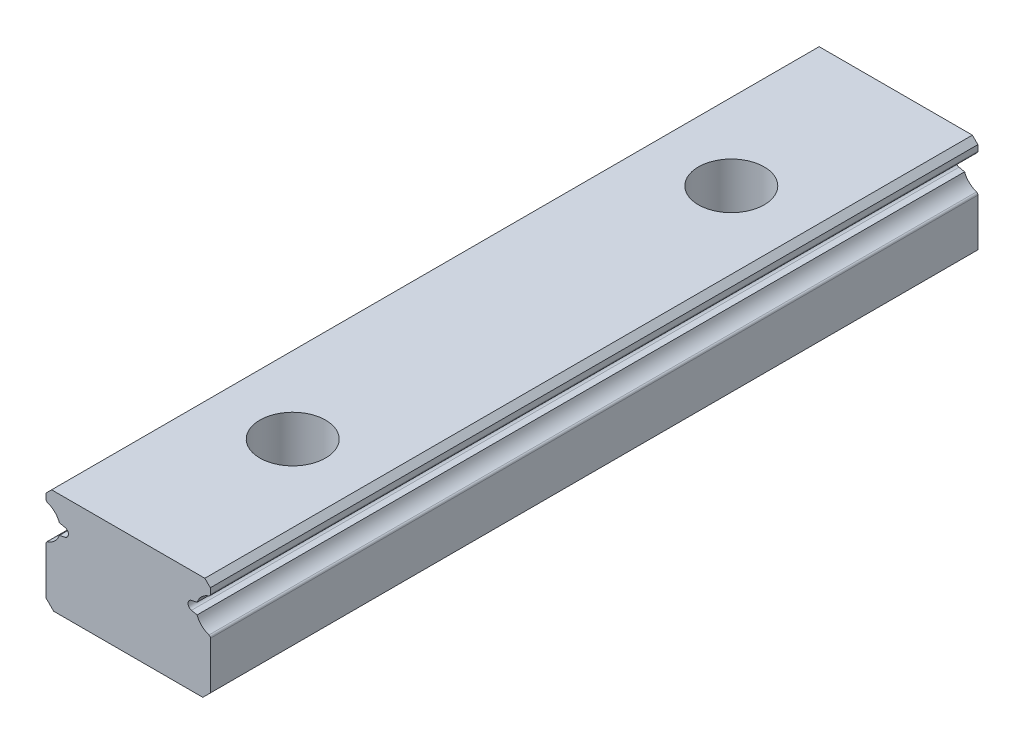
ISO-10303-21;
HEADER;
FILE_DESCRIPTION(('STEP AP214'),'2;1');
FILE_NAME('part.step','',(''),(''),'','','');
FILE_SCHEMA(('AUTOMOTIVE_DESIGN { 1 0 10303 214 1 1 1 1 }'));
ENDSEC;
DATA;
#1=APPLICATION_CONTEXT('core data for automotive mechanical design processes');
#2=APPLICATION_PROTOCOL_DEFINITION('international standard','automotive_design',2000,#1);
#3=PRODUCT_CONTEXT('',#1,'mechanical');
#4=PRODUCT('Part','Part','',(#3));
#5=PRODUCT_RELATED_PRODUCT_CATEGORY('part','',(#4));
#6=PRODUCT_DEFINITION_FORMATION('','',#4);
#7=PRODUCT_DEFINITION_CONTEXT('part definition',#1,'design');
#8=PRODUCT_DEFINITION('design','',#6,#7);
#9=PRODUCT_DEFINITION_SHAPE('','',#8);
#10=(LENGTH_UNIT() NAMED_UNIT(*) SI_UNIT(.MILLI.,.METRE.));
#11=(NAMED_UNIT(*) PLANE_ANGLE_UNIT() SI_UNIT($,.RADIAN.));
#12=(NAMED_UNIT(*) SI_UNIT($,.STERADIAN.) SOLID_ANGLE_UNIT());
#13=UNCERTAINTY_MEASURE_WITH_UNIT(LENGTH_MEASURE(1.E-05),#10,'distance_accuracy_value','');
#14=(GEOMETRIC_REPRESENTATION_CONTEXT(3) GLOBAL_UNCERTAINTY_ASSIGNED_CONTEXT((#13)) GLOBAL_UNIT_ASSIGNED_CONTEXT((#10,
#11,#12)) REPRESENTATION_CONTEXT('',''));
#15=CARTESIAN_POINT('',(0.,0.,0.));
#16=DIRECTION('',(0.,0.,1.));
#17=DIRECTION('',(1.,0.,0.));
#18=AXIS2_PLACEMENT_3D('',#15,#16,#17);
#19=CARTESIAN_POINT('',(-6.27999999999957,-8.749,-70.));
#20=DIRECTION('',(-0.209659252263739,-0.977774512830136,0.));
#21=DIRECTION('',(0.977774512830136,-0.209659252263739,0.));
#22=AXIS2_PLACEMENT_3D('',#19,#20,#21);
#23=PLANE('',#22);
#24=DIRECTION('',(0.977774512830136,-0.209659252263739,0.));
#25=VECTOR('',#24,1.);
#26=CARTESIAN_POINT('',(-6.27999999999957,-8.749,-70.));
#27=LINE('',#26,#25);
#28=CARTESIAN_POINT('',(-6.27999999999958,-8.749,-70.));
#29=VERTEX_POINT('',#28);
#30=CARTESIAN_POINT('',(-5.76751090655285,-8.85889044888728,-70.));
#31=VERTEX_POINT('',#30);
#32=EDGE_CURVE('E211',#29,#31,#27,.T.);
#33=ORIENTED_EDGE('',*,*,#32,.T.);
#34=DIRECTION('',(0.,0.,-1.));
#35=VECTOR('',#34,1.);
#36=CARTESIAN_POINT('',(-5.76751053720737,-8.85889052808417,-70.));
#37=LINE('',#36,#35);
#38=CARTESIAN_POINT('',(-5.76751090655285,-8.85889044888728,0.));
#39=VERTEX_POINT('',#38);
#40=EDGE_CURVE('E182',#31,#39,#37,.F.);
#41=ORIENTED_EDGE('',*,*,#40,.T.);
#42=DIRECTION('',(0.977774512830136,-0.209659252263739,0.));
#43=VECTOR('',#42,1.);
#44=CARTESIAN_POINT('',(-6.27999999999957,-8.749,0.));
#45=LINE('',#44,#43);
#46=CARTESIAN_POINT('',(-6.27999999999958,-8.749,0.));
#47=VERTEX_POINT('',#46);
#48=EDGE_CURVE('E219',#39,#47,#45,.F.);
#49=ORIENTED_EDGE('',*,*,#48,.T.);
#50=DIRECTION('',(0.,0.,-1.));
#51=VECTOR('',#50,1.);
#52=CARTESIAN_POINT('',(-6.27999999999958,-8.749,-70.));
#53=LINE('',#52,#51);
#54=EDGE_CURVE('E214',#47,#29,#53,.T.);
#55=ORIENTED_EDGE('',*,*,#54,.T.);
#56=EDGE_LOOP('',(#33,#41,#49,#55));
#57=FACE_BOUND('',#56,.T.);
#58=ADVANCED_FACE('F16',(#57),#23,.T.);
#59=CARTESIAN_POINT('',(5.7675105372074,-8.85889052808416,-70.));
#60=DIRECTION('',(0.20965925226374,-0.977774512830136,0.));
#61=DIRECTION('',(0.977774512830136,0.20965925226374,0.));
#62=AXIS2_PLACEMENT_3D('',#59,#60,#61);
#63=PLANE('',#62);
#64=DIRECTION('',(0.977774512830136,0.20965925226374,0.));
#65=VECTOR('',#64,1.);
#66=CARTESIAN_POINT('',(5.7675105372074,-8.85889052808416,-70.));
#67=LINE('',#66,#65);
#68=CARTESIAN_POINT('',(5.76751090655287,-8.85889044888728,-70.));
#69=VERTEX_POINT('',#68);
#70=CARTESIAN_POINT('',(6.27999999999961,-8.749,-70.));
#71=VERTEX_POINT('',#70);
#72=EDGE_CURVE('E184',#69,#71,#67,.T.);
#73=ORIENTED_EDGE('',*,*,#72,.T.);
#74=DIRECTION('',(0.,0.,-1.));
#75=VECTOR('',#74,1.);
#76=CARTESIAN_POINT('',(6.27999999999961,-8.749,-70.));
#77=LINE('',#76,#75);
#78=CARTESIAN_POINT('',(6.27999999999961,-8.749,0.));
#79=VERTEX_POINT('',#78);
#80=EDGE_CURVE('E222',#71,#79,#77,.F.);
#81=ORIENTED_EDGE('',*,*,#80,.T.);
#82=DIRECTION('',(0.977774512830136,0.20965925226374,0.));
#83=VECTOR('',#82,1.);
#84=CARTESIAN_POINT('',(5.7675105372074,-8.85889052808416,0.));
#85=LINE('',#84,#83);
#86=CARTESIAN_POINT('',(5.76751090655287,-8.85889044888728,0.));
#87=VERTEX_POINT('',#86);
#88=EDGE_CURVE('E209',#79,#87,#85,.F.);
#89=ORIENTED_EDGE('',*,*,#88,.T.);
#90=DIRECTION('',(0.,0.,-1.));
#91=VECTOR('',#90,1.);
#92=CARTESIAN_POINT('',(5.7675105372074,-8.85889052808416,-70.));
#93=LINE('',#92,#91);
#94=EDGE_CURVE('E204',#87,#69,#93,.T.);
#95=ORIENTED_EDGE('',*,*,#94,.T.);
#96=EDGE_LOOP('',(#73,#81,#89,#95));
#97=FACE_BOUND('',#96,.T.);
#98=ADVANCED_FACE('F749',(#97),#63,.T.);
#99=CARTESIAN_POINT('',(-5.85137497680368,-9.25000017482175,-70.));
#100=DIRECTION('',(0.,0.,-1.));
#101=DIRECTION('',(-1.,0.,0.));
#102=AXIS2_PLACEMENT_3D('',#99,#100,#101);
#103=CYLINDRICAL_SURFACE('',#102,0.4);
#104=ORIENTED_EDGE('',*,*,#40,.F.);
#105=CARTESIAN_POINT('',(-5.85137497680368,-9.25000017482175,-70.));
#106=DIRECTION('',(0.,0.,-1.));
#107=DIRECTION('',(-1.,0.,0.));
#108=AXIS2_PLACEMENT_3D('',#105,#106,#107);
#109=CIRCLE('',#108,0.4);
#110=CARTESIAN_POINT('',(-5.767,-9.641,-70.));
#111=VERTEX_POINT('',#110);
#112=EDGE_CURVE('E19',#111,#31,#109,.F.);
#113=ORIENTED_EDGE('',*,*,#112,.F.);
#114=DIRECTION('',(0.,0.,1.));
#115=VECTOR('',#114,1.);
#116=CARTESIAN_POINT('',(-5.767,-9.641,-70.));
#117=LINE('',#116,#115);
#118=CARTESIAN_POINT('',(-5.767,-9.641,0.));
#119=VERTEX_POINT('',#118);
#120=EDGE_CURVE('E179',#119,#111,#117,.F.);
#121=ORIENTED_EDGE('',*,*,#120,.F.);
#122=CARTESIAN_POINT('',(-5.85137497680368,-9.25000017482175,0.));
#123=DIRECTION('',(0.,0.,-1.));
#124=DIRECTION('',(-1.,0.,0.));
#125=AXIS2_PLACEMENT_3D('',#122,#123,#124);
#126=CIRCLE('',#125,0.4);
#127=EDGE_CURVE('E226',#39,#119,#126,.T.);
#128=ORIENTED_EDGE('',*,*,#127,.F.);
#129=EDGE_LOOP('',(#104,#113,#121,#128));
#130=FACE_BOUND('',#129,.T.);
#131=ADVANCED_FACE('F176',(#130),#103,.F.);
#132=CARTESIAN_POINT('',(7.89004225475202,-9.33975285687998,-70.));
#133=DIRECTION('',(0.,0.,-1.));
#134=DIRECTION('',(-1.,0.,0.));
#135=AXIS2_PLACEMENT_3D('',#132,#133,#134);
#136=CYLINDRICAL_SURFACE('',#135,1.715);
#137=ORIENTED_EDGE('',*,*,#80,.F.);
#138=CARTESIAN_POINT('',(7.89004225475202,-9.33975285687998,-70.));
#139=DIRECTION('',(0.,0.,-1.));
#140=DIRECTION('',(-1.,0.,0.));
#141=AXIS2_PLACEMENT_3D('',#138,#139,#140);
#142=CIRCLE('',#141,1.715);
#143=CARTESIAN_POINT('',(7.35000000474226,-7.71199999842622,-70.));
#144=VERTEX_POINT('',#143);
#145=EDGE_CURVE('E225',#144,#71,#142,.F.);
#146=ORIENTED_EDGE('',*,*,#145,.F.);
#147=DIRECTION('',(0.,0.,-1.));
#148=VECTOR('',#147,1.);
#149=CARTESIAN_POINT('',(7.35000000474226,-7.71199999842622,-70.));
#150=LINE('',#149,#148);
#151=CARTESIAN_POINT('',(7.35000000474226,-7.71199999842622,0.));
#152=VERTEX_POINT('',#151);
#153=EDGE_CURVE('E202',#152,#144,#150,.T.);
#154=ORIENTED_EDGE('',*,*,#153,.F.);
#155=CARTESIAN_POINT('',(7.89004225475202,-9.33975285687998,0.));
#156=DIRECTION('',(0.,0.,-1.));
#157=DIRECTION('',(-1.,0.,0.));
#158=AXIS2_PLACEMENT_3D('',#155,#156,#157);
#159=CIRCLE('',#158,1.715);
#160=EDGE_CURVE('E218',#79,#152,#159,.T.);
#161=ORIENTED_EDGE('',*,*,#160,.F.);
#162=EDGE_LOOP('',(#137,#146,#154,#161));
#163=FACE_BOUND('',#162,.T.);
#164=ADVANCED_FACE('F733',(#163),#136,.F.);
#165=CARTESIAN_POINT('',(-7.890042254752,-9.33975285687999,-70.));
#166=DIRECTION('',(0.,0.,-1.));
#167=DIRECTION('',(-1.,0.,0.));
#168=AXIS2_PLACEMENT_3D('',#165,#166,#167);
#169=CYLINDRICAL_SURFACE('',#168,1.715);
#170=DIRECTION('',(0.,0.,-1.));
#171=VECTOR('',#170,1.);
#172=CARTESIAN_POINT('',(-7.34999999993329,-7.7120000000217,-70.));
#173=LINE('',#172,#171);
#174=CARTESIAN_POINT('',(-7.34999999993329,-7.71200000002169,-70.));
#175=VERTEX_POINT('',#174);
#176=CARTESIAN_POINT('',(-7.34999999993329,-7.7120000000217,0.));
#177=VERTEX_POINT('',#176);
#178=EDGE_CURVE('E285',#175,#177,#173,.F.);
#179=ORIENTED_EDGE('',*,*,#178,.F.);
#180=CARTESIAN_POINT('',(-7.890042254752,-9.33975285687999,-70.));
#181=DIRECTION('',(0.,0.,-1.));
#182=DIRECTION('',(-1.,0.,0.));
#183=AXIS2_PLACEMENT_3D('',#180,#181,#182);
#184=CIRCLE('',#183,1.715);
#185=EDGE_CURVE('E217',#29,#175,#184,.F.);
#186=ORIENTED_EDGE('',*,*,#185,.F.);
#187=ORIENTED_EDGE('',*,*,#54,.F.);
#188=CARTESIAN_POINT('',(-7.890042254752,-9.33975285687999,0.));
#189=DIRECTION('',(0.,0.,-1.));
#190=DIRECTION('',(-1.,0.,0.));
#191=AXIS2_PLACEMENT_3D('',#188,#189,#190);
#192=CIRCLE('',#191,1.715);
#193=EDGE_CURVE('E208',#177,#47,#192,.T.);
#194=ORIENTED_EDGE('',*,*,#193,.F.);
#195=EDGE_LOOP('',(#179,#186,#187,#194));
#196=FACE_BOUND('',#195,.T.);
#197=ADVANCED_FACE('F310',(#196),#169,.F.);
#198=CARTESIAN_POINT('',(5.85137497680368,-9.25000017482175,-70.));
#199=DIRECTION('',(0.,0.,-1.));
#200=DIRECTION('',(-1.,0.,0.));
#201=AXIS2_PLACEMENT_3D('',#198,#199,#200);
#202=CYLINDRICAL_SURFACE('',#201,0.4);
#203=DIRECTION('',(0.,0.,1.));
#204=VECTOR('',#203,1.);
#205=CARTESIAN_POINT('',(5.767,-9.641,-70.));
#206=LINE('',#205,#204);
#207=CARTESIAN_POINT('',(5.767,-9.641,-70.));
#208=VERTEX_POINT('',#207);
#209=CARTESIAN_POINT('',(5.767,-9.641,0.));
#210=VERTEX_POINT('',#209);
#211=EDGE_CURVE('E281',#208,#210,#206,.T.);
#212=ORIENTED_EDGE('',*,*,#211,.F.);
#213=CARTESIAN_POINT('',(5.85137497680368,-9.25000017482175,-70.));
#214=DIRECTION('',(0.,0.,-1.));
#215=DIRECTION('',(-1.,0.,0.));
#216=AXIS2_PLACEMENT_3D('',#213,#214,#215);
#217=CIRCLE('',#216,0.4);
#218=EDGE_CURVE('E207',#69,#208,#217,.F.);
#219=ORIENTED_EDGE('',*,*,#218,.F.);
#220=ORIENTED_EDGE('',*,*,#94,.F.);
#221=CARTESIAN_POINT('',(5.85137497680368,-9.25000017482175,0.));
#222=DIRECTION('',(0.,0.,-1.));
#223=DIRECTION('',(-1.,0.,0.));
#224=AXIS2_PLACEMENT_3D('',#221,#222,#223);
#225=CIRCLE('',#224,0.4);
#226=EDGE_CURVE('E198',#210,#87,#225,.T.);
#227=ORIENTED_EDGE('',*,*,#226,.F.);
#228=EDGE_LOOP('',(#212,#219,#220,#227));
#229=FACE_BOUND('',#228,.T.);
#230=ADVANCED_FACE('F717',(#229),#202,.F.);
#231=CARTESIAN_POINT('',(-5.767,-9.641,-70.));
#232=DIRECTION('',(-0.207835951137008,0.978163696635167,0.));
#233=DIRECTION('',(-0.978163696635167,-0.207835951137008,0.));
#234=AXIS2_PLACEMENT_3D('',#231,#232,#233);
#235=PLANE('',#234);
#236=DIRECTION('',(-0.978163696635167,-0.207835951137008,0.));
#237=VECTOR('',#236,1.);
#238=CARTESIAN_POINT('',(-5.767,-9.641,-70.));
#239=LINE('',#238,#237);
#240=CARTESIAN_POINT('',(-6.28,-9.75,-70.));
#241=VERTEX_POINT('',#240);
#242=EDGE_CURVE('E186',#111,#241,#239,.T.);
#243=ORIENTED_EDGE('',*,*,#242,.T.);
#244=DIRECTION('',(0.,0.,-1.));
#245=VECTOR('',#244,1.);
#246=CARTESIAN_POINT('',(-6.28,-9.75,-70.));
#247=LINE('',#246,#245);
#248=CARTESIAN_POINT('',(-6.28,-9.75,0.));
#249=VERTEX_POINT('',#248);
#250=EDGE_CURVE('E279',#241,#249,#247,.F.);
#251=ORIENTED_EDGE('',*,*,#250,.T.);
#252=DIRECTION('',(-0.978163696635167,-0.207835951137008,0.));
#253=VECTOR('',#252,1.);
#254=CARTESIAN_POINT('',(-5.767,-9.641,0.));
#255=LINE('',#254,#253);
#256=EDGE_CURVE('E196',#249,#119,#255,.F.);
#257=ORIENTED_EDGE('',*,*,#256,.T.);
#258=ORIENTED_EDGE('',*,*,#120,.T.);
#259=EDGE_LOOP('',(#243,#251,#257,#258));
#260=FACE_BOUND('',#259,.T.);
#261=ADVANCED_FACE('F195',(#260),#235,.T.);
#262=CARTESIAN_POINT('',(7.287,-7.52218166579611,-70.));
#263=DIRECTION('',(0.,0.,-1.));
#264=DIRECTION('',(-1.,0.,0.));
#265=AXIS2_PLACEMENT_3D('',#262,#263,#264);
#266=CYLINDRICAL_SURFACE('',#265,0.2);
#267=CARTESIAN_POINT('',(7.287,-7.52218166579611,-70.));
#268=DIRECTION('',(0.,0.,-1.));
#269=DIRECTION('',(-1.,0.,0.));
#270=AXIS2_PLACEMENT_3D('',#267,#268,#269);
#271=CIRCLE('',#270,0.2);
#272=CARTESIAN_POINT('',(7.487,-7.52218165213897,-70.));
#273=VERTEX_POINT('',#272);
#274=EDGE_CURVE('E289',#144,#273,#271,.F.);
#275=ORIENTED_EDGE('',*,*,#274,.T.);
#276=DIRECTION('',(0.,0.,-1.));
#277=VECTOR('',#276,1.);
#278=CARTESIAN_POINT('',(7.487,-7.52218163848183,-70.));
#279=LINE('',#278,#277);
#280=CARTESIAN_POINT('',(7.487,-7.52218165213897,0.));
#281=VERTEX_POINT('',#280);
#282=EDGE_CURVE('E347',#281,#273,#279,.T.);
#283=ORIENTED_EDGE('',*,*,#282,.F.);
#284=CARTESIAN_POINT('',(7.287,-7.52218166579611,0.));
#285=DIRECTION('',(0.,0.,-1.));
#286=DIRECTION('',(-1.,0.,0.));
#287=AXIS2_PLACEMENT_3D('',#284,#285,#286);
#288=CIRCLE('',#287,0.2);
#289=EDGE_CURVE('E193',#281,#152,#288,.T.);
#290=ORIENTED_EDGE('',*,*,#289,.T.);
#291=ORIENTED_EDGE('',*,*,#153,.T.);
#292=EDGE_LOOP('',(#275,#283,#290,#291));
#293=FACE_BOUND('',#292,.T.);
#294=ADVANCED_FACE('F702',(#293),#266,.T.);
#295=CARTESIAN_POINT('',(-7.288,-7.52185268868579,-70.));
#296=DIRECTION('',(0.,0.,-1.));
#297=DIRECTION('',(-1.,0.,0.));
#298=AXIS2_PLACEMENT_3D('',#295,#296,#297);
#299=CYLINDRICAL_SURFACE('',#298,0.200000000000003);
#300=CARTESIAN_POINT('',(-7.288,-7.52185268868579,-70.));
#301=DIRECTION('',(0.,0.,-1.));
#302=DIRECTION('',(-1.,0.,0.));
#303=AXIS2_PLACEMENT_3D('',#300,#301,#302);
#304=CIRCLE('',#303,0.200000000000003);
#305=CARTESIAN_POINT('',(-7.488,-7.52185267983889,-70.));
#306=VERTEX_POINT('',#305);
#307=EDGE_CURVE('E282',#306,#175,#304,.F.);
#308=ORIENTED_EDGE('',*,*,#307,.T.);
#309=ORIENTED_EDGE('',*,*,#178,.T.);
#310=CARTESIAN_POINT('',(-7.288,-7.52185268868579,0.));
#311=DIRECTION('',(0.,0.,-1.));
#312=DIRECTION('',(-1.,0.,0.));
#313=AXIS2_PLACEMENT_3D('',#310,#311,#312);
#314=CIRCLE('',#313,0.200000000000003);
#315=CARTESIAN_POINT('',(-7.488,-7.52185267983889,0.));
#316=VERTEX_POINT('',#315);
#317=EDGE_CURVE('E286',#177,#316,#314,.T.);
#318=ORIENTED_EDGE('',*,*,#317,.T.);
#319=DIRECTION('',(0.,0.,1.));
#320=VECTOR('',#319,1.);
#321=CARTESIAN_POINT('',(-7.488,-7.52185267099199,-70.));
#322=LINE('',#321,#320);
#323=EDGE_CURVE('E315',#306,#316,#322,.T.);
#324=ORIENTED_EDGE('',*,*,#323,.F.);
#325=EDGE_LOOP('',(#308,#309,#318,#324));
#326=FACE_BOUND('',#325,.T.);
#327=ADVANCED_FACE('F313',(#326),#299,.T.);
#328=CARTESIAN_POINT('',(6.28,-9.75,-70.));
#329=DIRECTION('',(0.207835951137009,0.978163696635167,0.));
#330=DIRECTION('',(-0.978163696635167,0.207835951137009,0.));
#331=AXIS2_PLACEMENT_3D('',#328,#329,#330);
#332=PLANE('',#331);
#333=DIRECTION('',(-0.978163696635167,0.207835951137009,0.));
#334=VECTOR('',#333,1.);
#335=CARTESIAN_POINT('',(6.28,-9.75,-70.));
#336=LINE('',#335,#334);
#337=CARTESIAN_POINT('',(6.28,-9.75,-70.));
#338=VERTEX_POINT('',#337);
#339=EDGE_CURVE('E371',#338,#208,#336,.T.);
#340=ORIENTED_EDGE('',*,*,#339,.T.);
#341=ORIENTED_EDGE('',*,*,#211,.T.);
#342=DIRECTION('',(-0.978163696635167,0.207835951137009,0.));
#343=VECTOR('',#342,1.);
#344=CARTESIAN_POINT('',(6.28,-9.75,0.));
#345=LINE('',#344,#343);
#346=CARTESIAN_POINT('',(6.28,-9.75,0.));
#347=VERTEX_POINT('',#346);
#348=EDGE_CURVE('E312',#210,#347,#345,.F.);
#349=ORIENTED_EDGE('',*,*,#348,.T.);
#350=DIRECTION('',(0.,0.,-1.));
#351=VECTOR('',#350,1.);
#352=CARTESIAN_POINT('',(6.28,-9.75,-70.));
#353=LINE('',#352,#351);
#354=EDGE_CURVE('E275',#347,#338,#353,.T.);
#355=ORIENTED_EDGE('',*,*,#354,.T.);
#356=EDGE_LOOP('',(#340,#341,#349,#355));
#357=FACE_BOUND('',#356,.T.);
#358=ADVANCED_FACE('F478',(#357),#332,.T.);
#359=CARTESIAN_POINT('',(-7.89007044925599,-9.159323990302,-70.));
#360=DIRECTION('',(0.,0.,-1.));
#361=DIRECTION('',(-1.,0.,0.));
#362=AXIS2_PLACEMENT_3D('',#359,#360,#361);
#363=CYLINDRICAL_SURFACE('',#362,1.715);
#364=ORIENTED_EDGE('',*,*,#250,.F.);
#365=CARTESIAN_POINT('',(-7.89007044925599,-9.159323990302,-70.));
#366=DIRECTION('',(0.,0.,-1.));
#367=DIRECTION('',(-1.,0.,0.));
#368=AXIS2_PLACEMENT_3D('',#365,#366,#367);
#369=CIRCLE('',#368,1.715);
#370=CARTESIAN_POINT('',(-7.36199999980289,-10.7909999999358,-70.));
#371=VERTEX_POINT('',#370);
#372=EDGE_CURVE('E189',#371,#241,#369,.F.);
#373=ORIENTED_EDGE('',*,*,#372,.F.);
#374=DIRECTION('',(0.,0.,-1.));
#375=VECTOR('',#374,1.);
#376=CARTESIAN_POINT('',(-7.36199999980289,-10.7909999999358,-70.));
#377=LINE('',#376,#375);
#378=CARTESIAN_POINT('',(-7.36199999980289,-10.7909999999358,0.));
#379=VERTEX_POINT('',#378);
#380=EDGE_CURVE('E266',#379,#371,#377,.T.);
#381=ORIENTED_EDGE('',*,*,#380,.F.);
#382=CARTESIAN_POINT('',(-7.89007044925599,-9.159323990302,0.));
#383=DIRECTION('',(0.,0.,-1.));
#384=DIRECTION('',(-1.,0.,0.));
#385=AXIS2_PLACEMENT_3D('',#382,#383,#384);
#386=CIRCLE('',#385,1.715);
#387=EDGE_CURVE('E276',#249,#379,#386,.T.);
#388=ORIENTED_EDGE('',*,*,#387,.F.);
#389=EDGE_LOOP('',(#364,#373,#381,#388));
#390=FACE_BOUND('',#389,.T.);
#391=ADVANCED_FACE('F475',(#390),#363,.F.);
#392=CARTESIAN_POINT('',(7.487,-7.52218163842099,-70.));
#393=DIRECTION('',(1.,0.,0.));
#394=DIRECTION('',(0.,0.,-1.));
#395=AXIS2_PLACEMENT_3D('',#392,#393,#394);
#396=PLANE('',#395);
#397=DIRECTION('',(0.,1.,0.));
#398=VECTOR('',#397,1.);
#399=CARTESIAN_POINT('',(7.487,-7.52218163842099,-70.));
#400=LINE('',#399,#398);
#401=CARTESIAN_POINT('',(7.487,-7.,-70.));
#402=VERTEX_POINT('',#401);
#403=EDGE_CURVE('E327',#273,#402,#400,.T.);
#404=ORIENTED_EDGE('',*,*,#403,.T.);
#405=DIRECTION('',(0.,0.,1.));
#406=VECTOR('',#405,1.);
#407=CARTESIAN_POINT('',(7.487,-7.,-70.));
#408=LINE('',#407,#406);
#409=CARTESIAN_POINT('',(7.487,-7.,0.));
#410=VERTEX_POINT('',#409);
#411=EDGE_CURVE('E354',#410,#402,#408,.F.);
#412=ORIENTED_EDGE('',*,*,#411,.F.);
#413=DIRECTION('',(0.,1.,0.));
#414=VECTOR('',#413,1.);
#415=CARTESIAN_POINT('',(7.487,-7.52218163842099,0.));
#416=LINE('',#415,#414);
#417=EDGE_CURVE('E278',#410,#281,#416,.F.);
#418=ORIENTED_EDGE('',*,*,#417,.T.);
#419=ORIENTED_EDGE('',*,*,#282,.T.);
#420=EDGE_LOOP('',(#404,#412,#418,#419));
#421=FACE_BOUND('',#420,.T.);
#422=ADVANCED_FACE('F477',(#421),#396,.T.);
#423=CARTESIAN_POINT('',(-7.488,-7.,-70.));
#424=DIRECTION('',(-1.,0.,0.));
#425=DIRECTION('',(0.,0.,1.));
#426=AXIS2_PLACEMENT_3D('',#423,#424,#425);
#427=PLANE('',#426);
#428=DIRECTION('',(0.,1.,0.));
#429=VECTOR('',#428,1.);
#430=CARTESIAN_POINT('',(-7.488,-7.,-70.));
#431=LINE('',#430,#429);
#432=CARTESIAN_POINT('',(-7.488,-7.,-70.));
#433=VERTEX_POINT('',#432);
#434=EDGE_CURVE('E319',#433,#306,#431,.F.);
#435=ORIENTED_EDGE('',*,*,#434,.T.);
#436=ORIENTED_EDGE('',*,*,#323,.T.);
#437=DIRECTION('',(0.,1.,0.));
#438=VECTOR('',#437,1.);
#439=CARTESIAN_POINT('',(-7.488,-7.,0.));
#440=LINE('',#439,#438);
#441=CARTESIAN_POINT('',(-7.488,-7.,0.));
#442=VERTEX_POINT('',#441);
#443=EDGE_CURVE('E325',#316,#442,#440,.T.);
#444=ORIENTED_EDGE('',*,*,#443,.T.);
#445=DIRECTION('',(0.,0.,1.));
#446=VECTOR('',#445,1.);
#447=CARTESIAN_POINT('',(-7.488,-7.,-70.));
#448=LINE('',#447,#446);
#449=EDGE_CURVE('E262',#433,#442,#448,.T.);
#450=ORIENTED_EDGE('',*,*,#449,.F.);
#451=EDGE_LOOP('',(#435,#436,#444,#450));
#452=FACE_BOUND('',#451,.T.);
#453=ADVANCED_FACE('F322',(#452),#427,.T.);
#454=CARTESIAN_POINT('',(7.890070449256,-9.159323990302,-70.));
#455=DIRECTION('',(0.,0.,-1.));
#456=DIRECTION('',(-1.,0.,0.));
#457=AXIS2_PLACEMENT_3D('',#454,#455,#456);
#458=CYLINDRICAL_SURFACE('',#457,1.715);
#459=DIRECTION('',(0.,0.,-1.));
#460=VECTOR('',#459,1.);
#461=CARTESIAN_POINT('',(7.36199999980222,-10.7909999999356,-70.));
#462=LINE('',#461,#460);
#463=CARTESIAN_POINT('',(7.36199999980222,-10.7909999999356,-70.));
#464=VERTEX_POINT('',#463);
#465=CARTESIAN_POINT('',(7.36199999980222,-10.7909999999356,0.));
#466=VERTEX_POINT('',#465);
#467=EDGE_CURVE('E256',#464,#466,#462,.F.);
#468=ORIENTED_EDGE('',*,*,#467,.F.);
#469=CARTESIAN_POINT('',(7.890070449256,-9.159323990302,-70.));
#470=DIRECTION('',(0.,0.,-1.));
#471=DIRECTION('',(-1.,0.,0.));
#472=AXIS2_PLACEMENT_3D('',#469,#470,#471);
#473=CIRCLE('',#472,1.715);
#474=EDGE_CURVE('E273',#338,#464,#473,.F.);
#475=ORIENTED_EDGE('',*,*,#474,.F.);
#476=ORIENTED_EDGE('',*,*,#354,.F.);
#477=CARTESIAN_POINT('',(7.890070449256,-9.159323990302,0.));
#478=DIRECTION('',(0.,0.,-1.));
#479=DIRECTION('',(-1.,0.,0.));
#480=AXIS2_PLACEMENT_3D('',#477,#478,#479);
#481=CIRCLE('',#480,1.715);
#482=EDGE_CURVE('E270',#466,#347,#481,.T.);
#483=ORIENTED_EDGE('',*,*,#482,.F.);
#484=EDGE_LOOP('',(#468,#475,#476,#483));
#485=FACE_BOUND('',#484,.T.);
#486=ADVANCED_FACE('F552',(#485),#458,.F.);
#487=CARTESIAN_POINT('',(-7.3,-10.9811473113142,-70.));
#488=DIRECTION('',(0.,0.,-1.));
#489=DIRECTION('',(-1.,0.,0.));
#490=AXIS2_PLACEMENT_3D('',#487,#488,#489);
#491=CYLINDRICAL_SURFACE('',#490,0.200000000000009);
#492=CARTESIAN_POINT('',(-7.3,-10.9811473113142,-70.));
#493=DIRECTION('',(0.,0.,-1.));
#494=DIRECTION('',(-1.,0.,0.));
#495=AXIS2_PLACEMENT_3D('',#492,#493,#494);
#496=CIRCLE('',#495,0.200000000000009);
#497=CARTESIAN_POINT('',(-7.5,-10.9811473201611,-70.));
#498=VERTEX_POINT('',#497);
#499=EDGE_CURVE('E263',#371,#498,#496,.F.);
#500=ORIENTED_EDGE('',*,*,#499,.T.);
#501=DIRECTION('',(0.,0.,1.));
#502=VECTOR('',#501,1.);
#503=CARTESIAN_POINT('',(-7.5,-10.981147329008,-70.));
#504=LINE('',#503,#502);
#505=CARTESIAN_POINT('',(-7.5,-10.9811473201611,0.));
#506=VERTEX_POINT('',#505);
#507=EDGE_CURVE('E252',#506,#498,#504,.F.);
#508=ORIENTED_EDGE('',*,*,#507,.F.);
#509=CARTESIAN_POINT('',(-7.3,-10.9811473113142,0.));
#510=DIRECTION('',(0.,0.,-1.));
#511=DIRECTION('',(-1.,0.,0.));
#512=AXIS2_PLACEMENT_3D('',#509,#510,#511);
#513=CIRCLE('',#512,0.200000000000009);
#514=EDGE_CURVE('E267',#506,#379,#513,.T.);
#515=ORIENTED_EDGE('',*,*,#514,.T.);
#516=ORIENTED_EDGE('',*,*,#380,.T.);
#517=EDGE_LOOP('',(#500,#508,#515,#516));
#518=FACE_BOUND('',#517,.T.);
#519=ADVANCED_FACE('F471',(#518),#491,.T.);
#520=CARTESIAN_POINT('',(0.,-16.,-15.));
#521=DIRECTION('',(0.,1.,0.));
#522=DIRECTION('',(0.,0.,1.));
#523=AXIS2_PLACEMENT_3D('',#520,#521,#522);
#524=CYLINDRICAL_SURFACE('',#523,3.);
#525=CARTESIAN_POINT('',(0.,-6.5,-15.));
#526=DIRECTION('',(0.,1.,0.));
#527=DIRECTION('',(0.,0.,1.));
#528=AXIS2_PLACEMENT_3D('',#525,#526,#527);
#529=CIRCLE('',#528,3.);
#530=CARTESIAN_POINT('',(0.,-6.5,-12.));
#531=VERTEX_POINT('',#530);
#532=EDGE_CURVE('E248',#531,#531,#529,.F.);
#533=ORIENTED_EDGE('',*,*,#532,.F.);
#534=EDGE_LOOP('',(#533));
#535=FACE_BOUND('',#534,.T.);
#536=CARTESIAN_POINT('',(0.,-11.,-15.));
#537=DIRECTION('',(0.,1.,0.));
#538=DIRECTION('',(0.,0.,1.));
#539=AXIS2_PLACEMENT_3D('',#536,#537,#538);
#540=CIRCLE('',#539,3.);
#541=CARTESIAN_POINT('',(0.,-11.,-12.));
#542=VERTEX_POINT('',#541);
#543=EDGE_CURVE('E253',#542,#542,#540,.T.);
#544=ORIENTED_EDGE('',*,*,#543,.F.);
#545=EDGE_LOOP('',(#544));
#546=FACE_BOUND('',#545,.T.);
#547=ADVANCED_FACE('F545',(#535,#546),#524,.F.);
#548=CARTESIAN_POINT('',(7.487,-7.,-70.));
#549=DIRECTION('',(0.707106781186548,0.707106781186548,0.));
#550=DIRECTION('',(-0.707106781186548,0.707106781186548,0.));
#551=AXIS2_PLACEMENT_3D('',#548,#549,#550);
#552=PLANE('',#551);
#553=DIRECTION('',(-0.707106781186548,0.707106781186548,0.));
#554=VECTOR('',#553,1.);
#555=CARTESIAN_POINT('',(7.487,-7.,-70.));
#556=LINE('',#555,#554);
#557=CARTESIAN_POINT('',(6.987,-6.5,-70.));
#558=VERTEX_POINT('',#557);
#559=EDGE_CURVE('E344',#402,#558,#556,.T.);
#560=ORIENTED_EDGE('',*,*,#559,.T.);
#561=DIRECTION('',(0.,0.,1.));
#562=VECTOR('',#561,1.);
#563=CARTESIAN_POINT('',(6.987,-6.5,-70.));
#564=LINE('',#563,#562);
#565=CARTESIAN_POINT('',(6.987,-6.5,0.));
#566=VERTEX_POINT('',#565);
#567=EDGE_CURVE('E251',#566,#558,#564,.F.);
#568=ORIENTED_EDGE('',*,*,#567,.F.);
#569=DIRECTION('',(-0.707106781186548,0.707106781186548,0.));
#570=VECTOR('',#569,1.);
#571=CARTESIAN_POINT('',(7.487,-7.,0.));
#572=LINE('',#571,#570);
#573=EDGE_CURVE('E265',#566,#410,#572,.F.);
#574=ORIENTED_EDGE('',*,*,#573,.T.);
#575=ORIENTED_EDGE('',*,*,#411,.T.);
#576=EDGE_LOOP('',(#560,#568,#574,#575));
#577=FACE_BOUND('',#576,.T.);
#578=ADVANCED_FACE('F541',(#577),#552,.T.);
#579=CARTESIAN_POINT('',(-6.988,-6.5,-70.));
#580=DIRECTION('',(-0.707106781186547,0.707106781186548,0.));
#581=DIRECTION('',(-0.707106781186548,-0.707106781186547,0.));
#582=AXIS2_PLACEMENT_3D('',#579,#580,#581);
#583=PLANE('',#582);
#584=DIRECTION('',(-0.707106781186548,-0.707106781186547,0.));
#585=VECTOR('',#584,1.);
#586=CARTESIAN_POINT('',(-6.988,-6.5,-70.));
#587=LINE('',#586,#585);
#588=CARTESIAN_POINT('',(-6.988,-6.5,-70.));
#589=VERTEX_POINT('',#588);
#590=EDGE_CURVE('E334',#589,#433,#587,.T.);
#591=ORIENTED_EDGE('',*,*,#590,.T.);
#592=ORIENTED_EDGE('',*,*,#449,.T.);
#593=DIRECTION('',(-0.707106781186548,-0.707106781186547,0.));
#594=VECTOR('',#593,1.);
#595=CARTESIAN_POINT('',(-6.988,-6.5,0.));
#596=LINE('',#595,#594);
#597=CARTESIAN_POINT('',(-6.988,-6.5,0.));
#598=VERTEX_POINT('',#597);
#599=EDGE_CURVE('E338',#442,#598,#596,.F.);
#600=ORIENTED_EDGE('',*,*,#599,.T.);
#601=DIRECTION('',(0.,0.,1.));
#602=VECTOR('',#601,1.);
#603=CARTESIAN_POINT('',(-6.988,-6.5,-70.));
#604=LINE('',#603,#602);
#605=EDGE_CURVE('E247',#589,#598,#604,.T.);
#606=ORIENTED_EDGE('',*,*,#605,.F.);
#607=EDGE_LOOP('',(#591,#592,#600,#606));
#608=FACE_BOUND('',#607,.T.);
#609=ADVANCED_FACE('F537',(#608),#583,.T.);
#610=CARTESIAN_POINT('',(7.3,-10.9811473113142,-70.));
#611=DIRECTION('',(0.,0.,-1.));
#612=DIRECTION('',(-1.,0.,0.));
#613=AXIS2_PLACEMENT_3D('',#610,#611,#612);
#614=CYLINDRICAL_SURFACE('',#613,0.2);
#615=CARTESIAN_POINT('',(7.3,-10.9811473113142,-70.));
#616=DIRECTION('',(0.,0.,-1.));
#617=DIRECTION('',(-1.,0.,0.));
#618=AXIS2_PLACEMENT_3D('',#615,#616,#617);
#619=CIRCLE('',#618,0.2);
#620=CARTESIAN_POINT('',(7.5,-10.9811473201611,-70.));
#621=VERTEX_POINT('',#620);
#622=EDGE_CURVE('E257',#621,#464,#619,.F.);
#623=ORIENTED_EDGE('',*,*,#622,.T.);
#624=ORIENTED_EDGE('',*,*,#467,.T.);
#625=CARTESIAN_POINT('',(7.3,-10.9811473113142,0.));
#626=DIRECTION('',(0.,0.,-1.));
#627=DIRECTION('',(-1.,0.,0.));
#628=AXIS2_PLACEMENT_3D('',#625,#626,#627);
#629=CIRCLE('',#628,0.2);
#630=CARTESIAN_POINT('',(7.5,-10.9811473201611,0.));
#631=VERTEX_POINT('',#630);
#632=EDGE_CURVE('E260',#466,#631,#629,.T.);
#633=ORIENTED_EDGE('',*,*,#632,.T.);
#634=DIRECTION('',(0.,0.,-1.));
#635=VECTOR('',#634,1.);
#636=CARTESIAN_POINT('',(7.5,-10.981147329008,-70.));
#637=LINE('',#636,#635);
#638=EDGE_CURVE('E243',#621,#631,#637,.F.);
#639=ORIENTED_EDGE('',*,*,#638,.F.);
#640=EDGE_LOOP('',(#623,#624,#633,#639));
#641=FACE_BOUND('',#640,.T.);
#642=ADVANCED_FACE('F533',(#641),#614,.T.);
#643=CARTESIAN_POINT('',(0.,-16.,-55.));
#644=DIRECTION('',(0.,1.,0.));
#645=DIRECTION('',(0.,0.,1.));
#646=AXIS2_PLACEMENT_3D('',#643,#644,#645);
#647=CYLINDRICAL_SURFACE('',#646,3.);
#648=CARTESIAN_POINT('',(0.,-6.5,-55.));
#649=DIRECTION('',(0.,1.,0.));
#650=DIRECTION('',(0.,0.,1.));
#651=AXIS2_PLACEMENT_3D('',#648,#649,#650);
#652=CIRCLE('',#651,3.);
#653=CARTESIAN_POINT('',(0.,-6.5,-52.));
#654=VERTEX_POINT('',#653);
#655=EDGE_CURVE('E244',#654,#654,#652,.F.);
#656=ORIENTED_EDGE('',*,*,#655,.F.);
#657=EDGE_LOOP('',(#656));
#658=FACE_BOUND('',#657,.T.);
#659=CARTESIAN_POINT('',(0.,-11.,-55.));
#660=DIRECTION('',(0.,1.,0.));
#661=DIRECTION('',(0.,0.,1.));
#662=AXIS2_PLACEMENT_3D('',#659,#660,#661);
#663=CIRCLE('',#662,3.);
#664=CARTESIAN_POINT('',(0.,-11.,-52.));
#665=VERTEX_POINT('',#664);
#666=EDGE_CURVE('E240',#665,#665,#663,.T.);
#667=ORIENTED_EDGE('',*,*,#666,.F.);
#668=EDGE_LOOP('',(#667));
#669=FACE_BOUND('',#668,.T.);
#670=ADVANCED_FACE('F529',(#658,#669),#647,.F.);
#671=CARTESIAN_POINT('',(0.,-11.,-18.));
#672=DIRECTION('',(0.,1.,0.));
#673=DIRECTION('',(0.,0.,1.));
#674=AXIS2_PLACEMENT_3D('',#671,#672,#673);
#675=PLANE('',#674);
#676=ORIENTED_EDGE('',*,*,#543,.T.);
#677=EDGE_LOOP('',(#676));
#678=FACE_BOUND('',#677,.T.);
#679=CARTESIAN_POINT('',(0.,-11.,-15.));
#680=DIRECTION('',(0.,1.,0.));
#681=DIRECTION('',(0.,0.,1.));
#682=AXIS2_PLACEMENT_3D('',#679,#680,#681);
#683=CIRCLE('',#682,1.75);
#684=CARTESIAN_POINT('',(0.,-11.,-13.25));
#685=VERTEX_POINT('',#684);
#686=EDGE_CURVE('E236',#685,#685,#683,.F.);
#687=ORIENTED_EDGE('',*,*,#686,.T.);
#688=EDGE_LOOP('',(#687));
#689=FACE_BOUND('',#688,.T.);
#690=ADVANCED_FACE('F526',(#678,#689),#675,.T.);
#691=CARTESIAN_POINT('',(-7.5,-10.981147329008,-70.));
#692=DIRECTION('',(-1.,0.,0.));
#693=DIRECTION('',(0.,0.,1.));
#694=AXIS2_PLACEMENT_3D('',#691,#692,#693);
#695=PLANE('',#694);
#696=DIRECTION('',(0.,1.,0.));
#697=VECTOR('',#696,1.);
#698=CARTESIAN_POINT('',(-7.5,-10.9811473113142,-70.));
#699=LINE('',#698,#697);
#700=CARTESIAN_POINT('',(-7.5,-15.3,-70.));
#701=VERTEX_POINT('',#700);
#702=EDGE_CURVE('E411',#498,#701,#699,.F.);
#703=ORIENTED_EDGE('',*,*,#702,.T.);
#704=DIRECTION('',(0.,0.,1.));
#705=VECTOR('',#704,1.);
#706=CARTESIAN_POINT('',(-7.5,-15.3,-70.));
#707=LINE('',#706,#705);
#708=CARTESIAN_POINT('',(-7.5,-15.3,0.));
#709=VERTEX_POINT('',#708);
#710=EDGE_CURVE('E404',#709,#701,#707,.F.);
#711=ORIENTED_EDGE('',*,*,#710,.F.);
#712=DIRECTION('',(0.,1.,0.));
#713=VECTOR('',#712,1.);
#714=CARTESIAN_POINT('',(-7.5,-10.9811473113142,0.));
#715=LINE('',#714,#713);
#716=EDGE_CURVE('E239',#506,#709,#715,.F.);
#717=ORIENTED_EDGE('',*,*,#716,.F.);
#718=ORIENTED_EDGE('',*,*,#507,.T.);
#719=EDGE_LOOP('',(#703,#711,#717,#718));
#720=FACE_BOUND('',#719,.T.);
#721=ADVANCED_FACE('F468',(#720),#695,.T.);
#722=CARTESIAN_POINT('',(6.987,-6.5,-70.));
#723=DIRECTION('',(0.,1.,0.));
#724=DIRECTION('',(0.,0.,1.));
#725=AXIS2_PLACEMENT_3D('',#722,#723,#724);
#726=PLANE('',#725);
#727=ORIENTED_EDGE('',*,*,#655,.T.);
#728=EDGE_LOOP('',(#727));
#729=FACE_BOUND('',#728,.T.);
#730=DIRECTION('',(1.,0.,0.));
#731=VECTOR('',#730,1.);
#732=CARTESIAN_POINT('',(-7.3,-6.5,-70.));
#733=LINE('',#732,#731);
#734=EDGE_CURVE('E388',#558,#589,#733,.F.);
#735=ORIENTED_EDGE('',*,*,#734,.T.);
#736=ORIENTED_EDGE('',*,*,#605,.T.);
#737=DIRECTION('',(1.,0.,0.));
#738=VECTOR('',#737,1.);
#739=CARTESIAN_POINT('',(-7.3,-6.5,0.));
#740=LINE('',#739,#738);
#741=EDGE_CURVE('E405',#566,#598,#740,.F.);
#742=ORIENTED_EDGE('',*,*,#741,.F.);
#743=ORIENTED_EDGE('',*,*,#567,.T.);
#744=EDGE_LOOP('',(#735,#736,#742,#743));
#745=FACE_BOUND('',#744,.T.);
#746=ORIENTED_EDGE('',*,*,#532,.T.);
#747=EDGE_LOOP('',(#746));
#748=FACE_BOUND('',#747,.T.);
#749=ADVANCED_FACE('F519',(#729,#745,#748),#726,.T.);
#750=CARTESIAN_POINT('',(7.5,-15.3,-70.));
#751=DIRECTION('',(1.,0.,0.));
#752=DIRECTION('',(0.,0.,-1.));
#753=AXIS2_PLACEMENT_3D('',#750,#751,#752);
#754=PLANE('',#753);
#755=DIRECTION('',(0.,1.,0.));
#756=VECTOR('',#755,1.);
#757=CARTESIAN_POINT('',(7.5,-10.9811473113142,-70.));
#758=LINE('',#757,#756);
#759=CARTESIAN_POINT('',(7.5,-15.3,-70.));
#760=VERTEX_POINT('',#759);
#761=EDGE_CURVE('E410',#760,#621,#758,.T.);
#762=ORIENTED_EDGE('',*,*,#761,.T.);
#763=ORIENTED_EDGE('',*,*,#638,.T.);
#764=DIRECTION('',(0.,1.,0.));
#765=VECTOR('',#764,1.);
#766=CARTESIAN_POINT('',(7.5,-10.9811473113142,0.));
#767=LINE('',#766,#765);
#768=CARTESIAN_POINT('',(7.5,-15.3,0.));
#769=VERTEX_POINT('',#768);
#770=EDGE_CURVE('E434',#769,#631,#767,.T.);
#771=ORIENTED_EDGE('',*,*,#770,.F.);
#772=DIRECTION('',(0.,0.,1.));
#773=VECTOR('',#772,1.);
#774=CARTESIAN_POINT('',(7.5,-15.3,-70.));
#775=LINE('',#774,#773);
#776=EDGE_CURVE('E235',#760,#769,#775,.T.);
#777=ORIENTED_EDGE('',*,*,#776,.F.);
#778=EDGE_LOOP('',(#762,#763,#771,#777));
#779=FACE_BOUND('',#778,.T.);
#780=ADVANCED_FACE('F515',(#779),#754,.T.);
#781=CARTESIAN_POINT('',(0.,-11.,-58.));
#782=DIRECTION('',(0.,1.,0.));
#783=DIRECTION('',(0.,0.,1.));
#784=AXIS2_PLACEMENT_3D('',#781,#782,#783);
#785=PLANE('',#784);
#786=ORIENTED_EDGE('',*,*,#666,.T.);
#787=EDGE_LOOP('',(#786));
#788=FACE_BOUND('',#787,.T.);
#789=CARTESIAN_POINT('',(0.,-11.,-55.));
#790=DIRECTION('',(0.,1.,0.));
#791=DIRECTION('',(0.,0.,1.));
#792=AXIS2_PLACEMENT_3D('',#789,#790,#791);
#793=CIRCLE('',#792,1.75);
#794=CARTESIAN_POINT('',(0.,-11.,-53.25));
#795=VERTEX_POINT('',#794);
#796=EDGE_CURVE('E232',#795,#795,#793,.F.);
#797=ORIENTED_EDGE('',*,*,#796,.T.);
#798=EDGE_LOOP('',(#797));
#799=FACE_BOUND('',#798,.T.);
#800=ADVANCED_FACE('F511',(#788,#799),#785,.T.);
#801=CARTESIAN_POINT('',(0.,-16.,-15.));
#802=DIRECTION('',(0.,1.,0.));
#803=DIRECTION('',(0.,0.,1.));
#804=AXIS2_PLACEMENT_3D('',#801,#802,#803);
#805=CYLINDRICAL_SURFACE('',#804,1.75);
#806=ORIENTED_EDGE('',*,*,#686,.F.);
#807=EDGE_LOOP('',(#806));
#808=FACE_BOUND('',#807,.T.);
#809=CARTESIAN_POINT('',(0.,-16.,-15.));
#810=DIRECTION('',(0.,1.,0.));
#811=DIRECTION('',(0.,0.,1.));
#812=AXIS2_PLACEMENT_3D('',#809,#810,#811);
#813=CIRCLE('',#812,1.75);
#814=CARTESIAN_POINT('',(0.,-16.,-13.25));
#815=VERTEX_POINT('',#814);
#816=EDGE_CURVE('E228',#815,#815,#813,.T.);
#817=ORIENTED_EDGE('',*,*,#816,.F.);
#818=EDGE_LOOP('',(#817));
#819=FACE_BOUND('',#818,.T.);
#820=ADVANCED_FACE('F508',(#808,#819),#805,.F.);
#821=CARTESIAN_POINT('',(-7.3,-10.9811473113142,0.));
#822=DIRECTION('',(0.,0.,1.));
#823=DIRECTION('',(1.,0.,0.));
#824=AXIS2_PLACEMENT_3D('',#821,#822,#823);
#825=PLANE('',#824);
#826=ORIENTED_EDGE('',*,*,#256,.F.);
#827=ORIENTED_EDGE('',*,*,#387,.T.);
#828=ORIENTED_EDGE('',*,*,#514,.F.);
#829=ORIENTED_EDGE('',*,*,#716,.T.);
#830=DIRECTION('',(0.70710678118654,-0.707106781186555,0.));
#831=VECTOR('',#830,1.);
#832=CARTESIAN_POINT('',(-7.5,-15.3,0.));
#833=LINE('',#832,#831);
#834=CARTESIAN_POINT('',(-6.8,-16.,0.));
#835=VERTEX_POINT('',#834);
#836=EDGE_CURVE('E401',#835,#709,#833,.F.);
#837=ORIENTED_EDGE('',*,*,#836,.F.);
#838=DIRECTION('',(1.,0.,0.));
#839=VECTOR('',#838,1.);
#840=CARTESIAN_POINT('',(-6.8,-16.,0.));
#841=LINE('',#840,#839);
#842=CARTESIAN_POINT('',(6.8,-16.,0.));
#843=VERTEX_POINT('',#842);
#844=EDGE_CURVE('E231',#843,#835,#841,.F.);
#845=ORIENTED_EDGE('',*,*,#844,.F.);
#846=DIRECTION('',(0.707106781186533,0.707106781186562,0.));
#847=VECTOR('',#846,1.);
#848=CARTESIAN_POINT('',(6.8,-16.,0.));
#849=LINE('',#848,#847);
#850=EDGE_CURVE('E385',#769,#843,#849,.F.);
#851=ORIENTED_EDGE('',*,*,#850,.F.);
#852=ORIENTED_EDGE('',*,*,#770,.T.);
#853=ORIENTED_EDGE('',*,*,#632,.F.);
#854=ORIENTED_EDGE('',*,*,#482,.T.);
#855=ORIENTED_EDGE('',*,*,#348,.F.);
#856=ORIENTED_EDGE('',*,*,#226,.T.);
#857=ORIENTED_EDGE('',*,*,#88,.F.);
#858=ORIENTED_EDGE('',*,*,#160,.T.);
#859=ORIENTED_EDGE('',*,*,#289,.F.);
#860=ORIENTED_EDGE('',*,*,#417,.F.);
#861=ORIENTED_EDGE('',*,*,#573,.F.);
#862=ORIENTED_EDGE('',*,*,#741,.T.);
#863=ORIENTED_EDGE('',*,*,#599,.F.);
#864=ORIENTED_EDGE('',*,*,#443,.F.);
#865=ORIENTED_EDGE('',*,*,#317,.F.);
#866=ORIENTED_EDGE('',*,*,#193,.T.);
#867=ORIENTED_EDGE('',*,*,#48,.F.);
#868=ORIENTED_EDGE('',*,*,#127,.T.);
#869=EDGE_LOOP('',(#826,#827,#828,#829,#837,#845,#851,#852,#853,#854,#855,#856,#857,#858,#859,
#860,#861,#862,#863,#864,#865,#866,#867,#868));
#870=FACE_BOUND('',#869,.T.);
#871=ADVANCED_FACE('F301',(#870),#825,.T.);
#872=CARTESIAN_POINT('',(-7.5,-15.3,-70.));
#873=DIRECTION('',(-0.707106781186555,-0.70710678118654,0.));
#874=DIRECTION('',(0.70710678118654,-0.707106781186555,0.));
#875=AXIS2_PLACEMENT_3D('',#872,#873,#874);
#876=PLANE('',#875);
#877=DIRECTION('',(0.707106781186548,-0.707106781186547,0.));
#878=VECTOR('',#877,1.);
#879=CARTESIAN_POINT('',(-7.5,-15.3,-70.));
#880=LINE('',#879,#878);
#881=CARTESIAN_POINT('',(-6.8,-16.,-70.));
#882=VERTEX_POINT('',#881);
#883=EDGE_CURVE('E408',#701,#882,#880,.T.);
#884=ORIENTED_EDGE('',*,*,#883,.T.);
#885=DIRECTION('',(0.,0.,-1.));
#886=VECTOR('',#885,1.);
#887=CARTESIAN_POINT('',(-6.8,-16.,-70.));
#888=LINE('',#887,#886);
#889=EDGE_CURVE('E393',#835,#882,#888,.T.);
#890=ORIENTED_EDGE('',*,*,#889,.F.);
#891=ORIENTED_EDGE('',*,*,#836,.T.);
#892=ORIENTED_EDGE('',*,*,#710,.T.);
#893=EDGE_LOOP('',(#884,#890,#891,#892));
#894=FACE_BOUND('',#893,.T.);
#895=ADVANCED_FACE('F464',(#894),#876,.T.);
#896=CARTESIAN_POINT('',(-7.3,-10.9811473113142,-70.));
#897=DIRECTION('',(0.,0.,1.));
#898=DIRECTION('',(1.,0.,0.));
#899=AXIS2_PLACEMENT_3D('',#896,#897,#898);
#900=PLANE('',#899);
#901=ORIENTED_EDGE('',*,*,#372,.T.);
#902=ORIENTED_EDGE('',*,*,#242,.F.);
#903=ORIENTED_EDGE('',*,*,#112,.T.);
#904=ORIENTED_EDGE('',*,*,#32,.F.);
#905=ORIENTED_EDGE('',*,*,#185,.T.);
#906=ORIENTED_EDGE('',*,*,#307,.F.);
#907=ORIENTED_EDGE('',*,*,#434,.F.);
#908=ORIENTED_EDGE('',*,*,#590,.F.);
#909=ORIENTED_EDGE('',*,*,#734,.F.);
#910=ORIENTED_EDGE('',*,*,#559,.F.);
#911=ORIENTED_EDGE('',*,*,#403,.F.);
#912=ORIENTED_EDGE('',*,*,#274,.F.);
#913=ORIENTED_EDGE('',*,*,#145,.T.);
#914=ORIENTED_EDGE('',*,*,#72,.F.);
#915=ORIENTED_EDGE('',*,*,#218,.T.);
#916=ORIENTED_EDGE('',*,*,#339,.F.);
#917=ORIENTED_EDGE('',*,*,#474,.T.);
#918=ORIENTED_EDGE('',*,*,#622,.F.);
#919=ORIENTED_EDGE('',*,*,#761,.F.);
#920=DIRECTION('',(0.707106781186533,0.707106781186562,0.));
#921=VECTOR('',#920,1.);
#922=CARTESIAN_POINT('',(6.8,-16.,-70.));
#923=LINE('',#922,#921);
#924=CARTESIAN_POINT('',(6.8,-16.,-70.));
#925=VERTEX_POINT('',#924);
#926=EDGE_CURVE('E34',#925,#760,#923,.T.);
#927=ORIENTED_EDGE('',*,*,#926,.F.);
#928=DIRECTION('',(1.,0.,0.));
#929=VECTOR('',#928,1.);
#930=CARTESIAN_POINT('',(-6.8,-16.,-70.));
#931=LINE('',#930,#929);
#932=EDGE_CURVE('E398',#882,#925,#931,.T.);
#933=ORIENTED_EDGE('',*,*,#932,.F.);
#934=ORIENTED_EDGE('',*,*,#883,.F.);
#935=ORIENTED_EDGE('',*,*,#702,.F.);
#936=ORIENTED_EDGE('',*,*,#499,.F.);
#937=EDGE_LOOP('',(#901,#902,#903,#904,#905,#906,#907,#908,#909,#910,#911,#912,#913,#914,#915,
#916,#917,#918,#919,#927,#933,#934,#935,#936));
#938=FACE_BOUND('',#937,.T.);
#939=ADVANCED_FACE('F187',(#938),#900,.F.);
#940=CARTESIAN_POINT('',(6.8,-16.,-70.));
#941=DIRECTION('',(0.707106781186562,-0.707106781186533,0.));
#942=DIRECTION('',(0.707106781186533,0.707106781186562,0.));
#943=AXIS2_PLACEMENT_3D('',#940,#941,#942);
#944=PLANE('',#943);
#945=ORIENTED_EDGE('',*,*,#926,.T.);
#946=ORIENTED_EDGE('',*,*,#776,.T.);
#947=ORIENTED_EDGE('',*,*,#850,.T.);
#948=DIRECTION('',(0.,0.,-1.));
#949=VECTOR('',#948,1.);
#950=CARTESIAN_POINT('',(6.8,-16.,-70.));
#951=LINE('',#950,#949);
#952=EDGE_CURVE('E25',#925,#843,#951,.F.);
#953=ORIENTED_EDGE('',*,*,#952,.F.);
#954=EDGE_LOOP('',(#945,#946,#947,#953));
#955=FACE_BOUND('',#954,.T.);
#956=ADVANCED_FACE('F457',(#955),#944,.T.);
#957=CARTESIAN_POINT('',(0.,-16.,-55.));
#958=DIRECTION('',(0.,1.,0.));
#959=DIRECTION('',(0.,0.,1.));
#960=AXIS2_PLACEMENT_3D('',#957,#958,#959);
#961=CYLINDRICAL_SURFACE('',#960,1.75);
#962=ORIENTED_EDGE('',*,*,#796,.F.);
#963=EDGE_LOOP('',(#962));
#964=FACE_BOUND('',#963,.T.);
#965=CARTESIAN_POINT('',(0.,-16.,-55.));
#966=DIRECTION('',(0.,1.,0.));
#967=DIRECTION('',(0.,0.,1.));
#968=AXIS2_PLACEMENT_3D('',#965,#966,#967);
#969=CIRCLE('',#968,1.75);
#970=CARTESIAN_POINT('',(0.,-16.,-53.25));
#971=VERTEX_POINT('',#970);
#972=EDGE_CURVE('E11',#971,#971,#969,.T.);
#973=ORIENTED_EDGE('',*,*,#972,.F.);
#974=EDGE_LOOP('',(#973));
#975=FACE_BOUND('',#974,.T.);
#976=ADVANCED_FACE('F490',(#964,#975),#961,.F.);
#977=CARTESIAN_POINT('',(-6.8,-16.,-70.));
#978=DIRECTION('',(0.,-1.,0.));
#979=DIRECTION('',(0.,0.,-1.));
#980=AXIS2_PLACEMENT_3D('',#977,#978,#979);
#981=PLANE('',#980);
#982=ORIENTED_EDGE('',*,*,#972,.T.);
#983=EDGE_LOOP('',(#982));
#984=FACE_BOUND('',#983,.T.);
#985=ORIENTED_EDGE('',*,*,#932,.T.);
#986=ORIENTED_EDGE('',*,*,#952,.T.);
#987=ORIENTED_EDGE('',*,*,#844,.T.);
#988=ORIENTED_EDGE('',*,*,#889,.T.);
#989=EDGE_LOOP('',(#985,#986,#987,#988));
#990=FACE_BOUND('',#989,.T.);
#991=ORIENTED_EDGE('',*,*,#816,.T.);
#992=EDGE_LOOP('',(#991));
#993=FACE_BOUND('',#992,.T.);
#994=ADVANCED_FACE('F454',(#984,#990,#993),#981,.T.);
#995=CLOSED_SHELL('',(#58,#98,#131,#164,#197,#230,#261,#294,#327,#358,#391,#422,#453,#486,#519,
#547,#578,#609,#642,#670,#690,#721,#749,#780,#800,#820,#871,#895,#939,#956,#976,#994));
#996=MANIFOLD_SOLID_BREP('B1',#995);
#997=ADVANCED_BREP_SHAPE_REPRESENTATION('',(#18,#996),#14);
#998=SHAPE_DEFINITION_REPRESENTATION(#9,#997);
ENDSEC;
END-ISO-10303-21;
